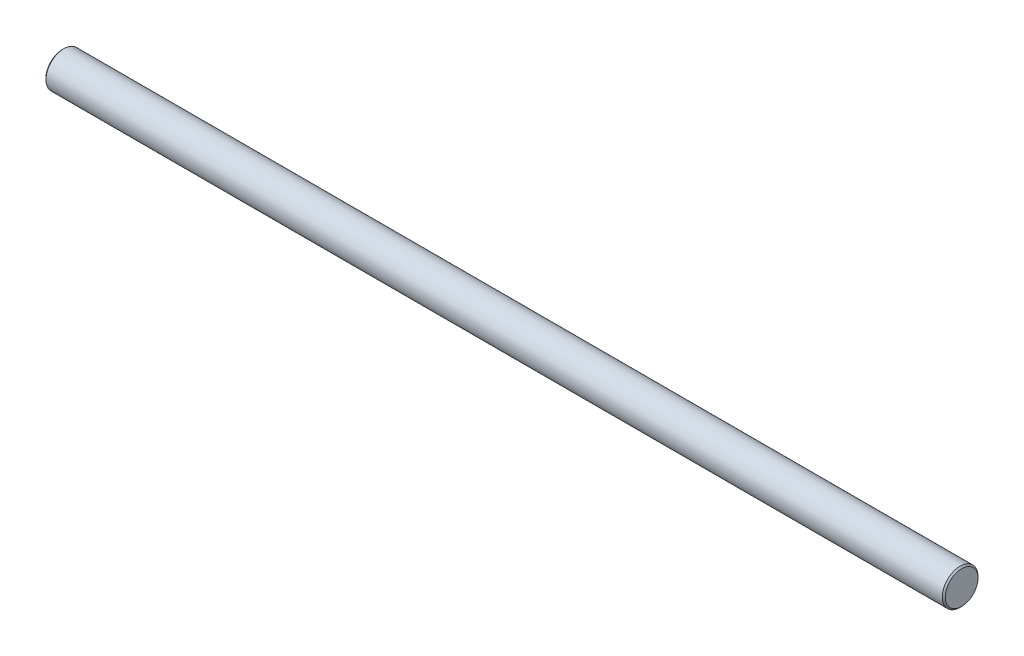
ISO-10303-21;
HEADER;
FILE_DESCRIPTION(('STEP AP214'),'2;1');
FILE_NAME('part.step','',(''),(''),'','','');
FILE_SCHEMA(('AUTOMOTIVE_DESIGN { 1 0 10303 214 1 1 1 1 }'));
ENDSEC;
DATA;
#1=APPLICATION_CONTEXT('core data for automotive mechanical design processes');
#2=APPLICATION_PROTOCOL_DEFINITION('international standard','automotive_design',2000,#1);
#3=PRODUCT_CONTEXT('',#1,'mechanical');
#4=PRODUCT('Part','Part','',(#3));
#5=PRODUCT_RELATED_PRODUCT_CATEGORY('part','',(#4));
#6=PRODUCT_DEFINITION_FORMATION('','',#4);
#7=PRODUCT_DEFINITION_CONTEXT('part definition',#1,'design');
#8=PRODUCT_DEFINITION('design','',#6,#7);
#9=PRODUCT_DEFINITION_SHAPE('','',#8);
#10=(LENGTH_UNIT() NAMED_UNIT(*) SI_UNIT(.MILLI.,.METRE.));
#11=(NAMED_UNIT(*) PLANE_ANGLE_UNIT() SI_UNIT($,.RADIAN.));
#12=(NAMED_UNIT(*) SI_UNIT($,.STERADIAN.) SOLID_ANGLE_UNIT());
#13=UNCERTAINTY_MEASURE_WITH_UNIT(LENGTH_MEASURE(1.E-05),#10,'distance_accuracy_value','');
#14=(GEOMETRIC_REPRESENTATION_CONTEXT(3) GLOBAL_UNCERTAINTY_ASSIGNED_CONTEXT((#13)) GLOBAL_UNIT_ASSIGNED_CONTEXT((#10,
#11,#12)) REPRESENTATION_CONTEXT('',''));
#15=CARTESIAN_POINT('',(0.,0.,0.));
#16=DIRECTION('',(0.,0.,1.));
#17=DIRECTION('',(1.,0.,0.));
#18=AXIS2_PLACEMENT_3D('',#15,#16,#17);
#19=CARTESIAN_POINT('',(151.,0.,0.));
#20=DIRECTION('',(-1.,0.,0.));
#21=DIRECTION('',(0.,0.,1.));
#22=AXIS2_PLACEMENT_3D('',#19,#20,#21);
#23=CYLINDRICAL_SURFACE('',#22,3.);
#24=CARTESIAN_POINT('',(0.250000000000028,0.,0.));
#25=DIRECTION('',(1.,0.,0.));
#26=DIRECTION('',(0.,0.,-1.));
#27=AXIS2_PLACEMENT_3D('',#24,#25,#26);
#28=CIRCLE('',#27,3.);
#29=CARTESIAN_POINT('',(0.250000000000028,0.,-3.));
#30=VERTEX_POINT('',#29);
#31=EDGE_CURVE('E40',#30,#30,#28,.T.);
#32=ORIENTED_EDGE('',*,*,#31,.T.);
#33=EDGE_LOOP('',(#32));
#34=FACE_BOUND('',#33,.T.);
#35=CARTESIAN_POINT('',(150.75,0.,0.));
#36=DIRECTION('',(1.,0.,0.));
#37=DIRECTION('',(0.,0.,-1.));
#38=AXIS2_PLACEMENT_3D('',#35,#36,#37);
#39=CIRCLE('',#38,3.);
#40=CARTESIAN_POINT('',(150.75,0.,-3.));
#41=VERTEX_POINT('',#40);
#42=EDGE_CURVE('E44',#41,#41,#39,.F.);
#43=ORIENTED_EDGE('',*,*,#42,.T.);
#44=EDGE_LOOP('',(#43));
#45=FACE_BOUND('',#44,.T.);
#46=ADVANCED_FACE('F29',(#34,#45),#23,.T.);
#47=CARTESIAN_POINT('',(151.,0.,0.));
#48=DIRECTION('',(1.,0.,0.));
#49=DIRECTION('',(0.,0.,-1.));
#50=AXIS2_PLACEMENT_3D('',#47,#48,#49);
#51=PLANE('',#50);
#52=CARTESIAN_POINT('',(151.,0.,0.));
#53=DIRECTION('',(1.,0.,0.));
#54=DIRECTION('',(0.,0.,-1.));
#55=AXIS2_PLACEMENT_3D('',#52,#53,#54);
#56=CIRCLE('',#55,2.74999999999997);
#57=CARTESIAN_POINT('',(151.,0.,-2.74999999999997));
#58=VERTEX_POINT('',#57);
#59=EDGE_CURVE('E10',#58,#58,#56,.T.);
#60=ORIENTED_EDGE('',*,*,#59,.T.);
#61=EDGE_LOOP('',(#60));
#62=FACE_BOUND('',#61,.T.);
#63=ADVANCED_FACE('F60',(#62),#51,.T.);
#64=CARTESIAN_POINT('',(0.,0.,0.));
#65=DIRECTION('',(1.,0.,0.));
#66=DIRECTION('',(0.,0.,-1.));
#67=AXIS2_PLACEMENT_3D('',#64,#65,#66);
#68=PLANE('',#67);
#69=CARTESIAN_POINT('',(0.,0.,0.));
#70=DIRECTION('',(1.,0.,0.));
#71=DIRECTION('',(0.,0.,-1.));
#72=AXIS2_PLACEMENT_3D('',#69,#70,#71);
#73=CIRCLE('',#72,2.74999999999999);
#74=CARTESIAN_POINT('',(0.,0.,-2.74999999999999));
#75=VERTEX_POINT('',#74);
#76=EDGE_CURVE('E36',#75,#75,#73,.F.);
#77=ORIENTED_EDGE('',*,*,#76,.T.);
#78=EDGE_LOOP('',(#77));
#79=FACE_BOUND('',#78,.T.);
#80=ADVANCED_FACE('F57',(#79),#68,.F.);
#81=CARTESIAN_POINT('',(0.250000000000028,0.,0.));
#82=DIRECTION('',(1.,0.,0.));
#83=DIRECTION('',(0.,0.,-1.));
#84=AXIS2_PLACEMENT_3D('',#81,#82,#83);
#85=CONICAL_SURFACE('',#84,3.,0.785398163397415);
#86=ORIENTED_EDGE('',*,*,#76,.F.);
#87=EDGE_LOOP('',(#86));
#88=FACE_BOUND('',#87,.T.);
#89=ORIENTED_EDGE('',*,*,#31,.F.);
#90=EDGE_LOOP('',(#89));
#91=FACE_BOUND('',#90,.T.);
#92=ADVANCED_FACE('F53',(#88,#91),#85,.T.);
#93=CARTESIAN_POINT('',(151.,0.,0.));
#94=DIRECTION('',(-1.,0.,0.));
#95=DIRECTION('',(0.,0.,1.));
#96=AXIS2_PLACEMENT_3D('',#93,#94,#95);
#97=CONICAL_SURFACE('',#96,2.74999999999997,0.785398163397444);
#98=ORIENTED_EDGE('',*,*,#42,.F.);
#99=EDGE_LOOP('',(#98));
#100=FACE_BOUND('',#99,.T.);
#101=ORIENTED_EDGE('',*,*,#59,.F.);
#102=EDGE_LOOP('',(#101));
#103=FACE_BOUND('',#102,.T.);
#104=ADVANCED_FACE('F31',(#100,#103),#97,.T.);
#105=CLOSED_SHELL('',(#46,#63,#80,#92,#104));
#106=MANIFOLD_SOLID_BREP('B2',#105);
#107=ADVANCED_BREP_SHAPE_REPRESENTATION('',(#18,#106),#14);
#108=SHAPE_DEFINITION_REPRESENTATION(#9,#107);
ENDSEC;
END-ISO-10303-21;
